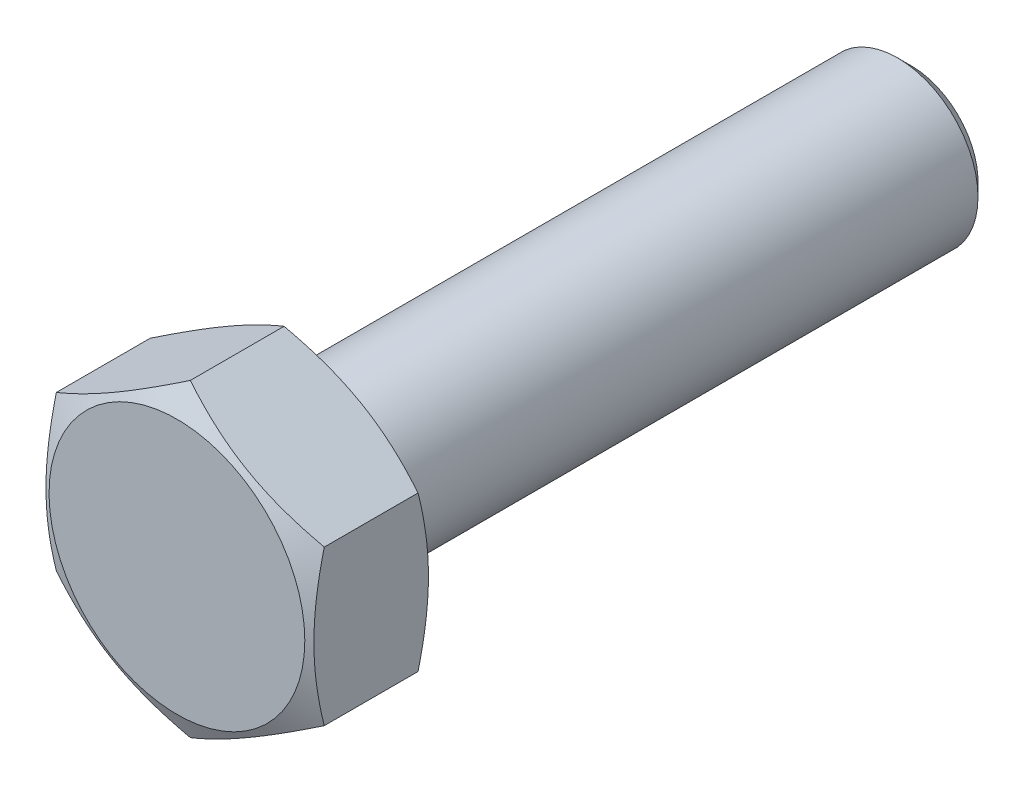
from build123d import *

# Parameters (mm, degrees)
BASE_EXTRUSION_DEPTH = 4.5
ESQUISSE2_R          = 3
BOSS_EXTRU_1_DEPTH   = 22.9
CHANFREIN1_SIZE      = 0.5
ESQUISSE3_W          = 1
ESQUISSE3_H          = 0.15


with BuildPart() as part:
    # Esquisse1 → Base-Extrusion (new body)
    with BuildSketch(Plane.XY):
        Polygon((0, 5.773502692), (-5, 2.886751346), (-5, -2.886751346), (0, -5.773502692), (5, -2.886751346), (5, 2.886751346), align=None)
    extrude(amount=-BASE_EXTRUSION_DEPTH)

    # Esquisse2 → Boss.-Extru.1 (add)
    with BuildSketch(Plane(origin=(0, 0, -4.5), x_dir=(-1, 0, 0), z_dir=(0, 0, -1))):
        with Locations(Location((0, 0, 0), (0, 0, 180))):
            Circle(ESQUISSE2_R)
    extrude(amount=BOSS_EXTRU_1_DEPTH)

    # Chanfrein1
    chanfrein1_edges = [part.edges().sort_by_distance(p)[0] for p in [
        (-3, 0, -27.4),
    ]]
    chamfer(chanfrein1_edges, length=CHANFREIN1_SIZE)

    # Esquisse3 → Enl_vement de mati_re-R_volution1 (revolve, cut)
    with BuildSketch(Plane(origin=(0, 0, 0), x_dir=(0, 0, -1), z_dir=(1, 0, 0)), mode=Mode.PRIVATE) as enl_vement_de_mati_re_r_volution1_sk:
        Polygon((0, 4.773502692), (0, 5.773502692), (0.5, 5.773502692), align=None)
        Polygon((4.5, 4.773502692), (4.5, 5.773502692), (4, 5.773502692), align=None)
        with Locations((5, 2.925)):
            Rectangle(ESQUISSE3_W, ESQUISSE3_H)
    revolve(enl_vement_de_mati_re_r_volution1_sk.sketch.rotate(Axis((0, 0, 0.886183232), (0, 0, -1)), 90), axis=Axis((0, 0, 0.886183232), (0, 0, -1)), mode=Mode.SUBTRACT)


solid = part.part
